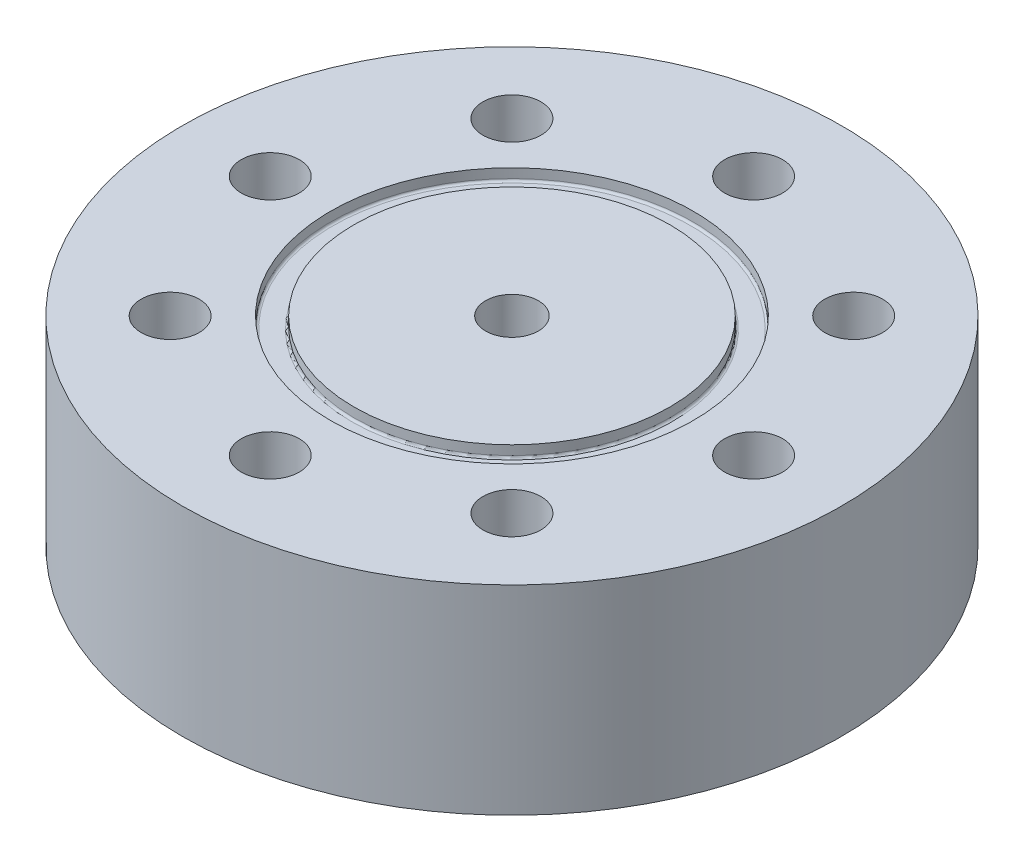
ISO-10303-21;
HEADER;
FILE_DESCRIPTION(('STEP AP214'),'2;1');
FILE_NAME('part.step','',(''),(''),'','','');
FILE_SCHEMA(('AUTOMOTIVE_DESIGN { 1 0 10303 214 1 1 1 1 }'));
ENDSEC;
DATA;
#1=APPLICATION_CONTEXT('core data for automotive mechanical design processes');
#2=APPLICATION_PROTOCOL_DEFINITION('international standard','automotive_design',2000,#1);
#3=PRODUCT_CONTEXT('',#1,'mechanical');
#4=PRODUCT('Part','Part','',(#3));
#5=PRODUCT_RELATED_PRODUCT_CATEGORY('part','',(#4));
#6=PRODUCT_DEFINITION_FORMATION('','',#4);
#7=PRODUCT_DEFINITION_CONTEXT('part definition',#1,'design');
#8=PRODUCT_DEFINITION('design','',#6,#7);
#9=PRODUCT_DEFINITION_SHAPE('','',#8);
#10=(LENGTH_UNIT() NAMED_UNIT(*) SI_UNIT(.MILLI.,.METRE.));
#11=(NAMED_UNIT(*) PLANE_ANGLE_UNIT() SI_UNIT($,.RADIAN.));
#12=(NAMED_UNIT(*) SI_UNIT($,.STERADIAN.) SOLID_ANGLE_UNIT());
#13=UNCERTAINTY_MEASURE_WITH_UNIT(LENGTH_MEASURE(1.E-05),#10,'distance_accuracy_value','');
#14=(GEOMETRIC_REPRESENTATION_CONTEXT(3) GLOBAL_UNCERTAINTY_ASSIGNED_CONTEXT((#13)) GLOBAL_UNIT_ASSIGNED_CONTEXT((#10,
#11,#12)) REPRESENTATION_CONTEXT('',''));
#15=CARTESIAN_POINT('',(0.,0.,0.));
#16=DIRECTION('',(0.,0.,1.));
#17=DIRECTION('',(1.,0.,0.));
#18=AXIS2_PLACEMENT_3D('',#15,#16,#17);
#19=CARTESIAN_POINT('',(0.,22.7,0.));
#20=DIRECTION('',(0.,-1.,0.));
#21=DIRECTION('',(0.,0.,-1.));
#22=AXIS2_PLACEMENT_3D('',#19,#20,#21);
#23=CYLINDRICAL_SURFACE('',#22,37.5);
#24=CARTESIAN_POINT('',(0.,22.7,0.));
#25=DIRECTION('',(0.,1.,0.));
#26=DIRECTION('',(0.,0.,1.));
#27=AXIS2_PLACEMENT_3D('',#24,#25,#26);
#28=CIRCLE('',#27,37.5);
#29=CARTESIAN_POINT('',(0.,22.7,37.5));
#30=VERTEX_POINT('',#29);
#31=EDGE_CURVE('E60',#30,#30,#28,.T.);
#32=ORIENTED_EDGE('',*,*,#31,.F.);
#33=EDGE_LOOP('',(#32));
#34=FACE_BOUND('',#33,.T.);
#35=CARTESIAN_POINT('',(0.,0.,0.));
#36=DIRECTION('',(0.,1.,0.));
#37=DIRECTION('',(0.,0.,1.));
#38=AXIS2_PLACEMENT_3D('',#35,#36,#37);
#39=CIRCLE('',#38,37.5);
#40=CARTESIAN_POINT('',(0.,0.,37.5));
#41=VERTEX_POINT('',#40);
#42=EDGE_CURVE('E61',#41,#41,#39,.T.);
#43=ORIENTED_EDGE('',*,*,#42,.T.);
#44=EDGE_LOOP('',(#43));
#45=FACE_BOUND('',#44,.T.);
#46=ADVANCED_FACE('F36',(#34,#45),#23,.T.);
#47=CARTESIAN_POINT('',(0.,22.7,0.));
#48=DIRECTION('',(0.,1.,0.));
#49=DIRECTION('',(0.,0.,1.));
#50=AXIS2_PLACEMENT_3D('',#47,#48,#49);
#51=PLANE('',#50);
#52=CARTESIAN_POINT('',(0.,22.7,0.));
#53=DIRECTION('',(0.,1.,0.));
#54=DIRECTION('',(0.,0.,1.));
#55=AXIS2_PLACEMENT_3D('',#52,#53,#54);
#56=CIRCLE('',#55,20.6375);
#57=CARTESIAN_POINT('',(0.,22.7,20.6375));
#58=VERTEX_POINT('',#57);
#59=EDGE_CURVE('E82',#58,#58,#56,.T.);
#60=ORIENTED_EDGE('',*,*,#59,.F.);
#61=EDGE_LOOP('',(#60));
#62=FACE_BOUND('',#61,.T.);
#63=CARTESIAN_POINT('',(-27.5,22.7,0.));
#64=DIRECTION('',(0.,-1.,0.));
#65=DIRECTION('',(0.,0.,-1.));
#66=AXIS2_PLACEMENT_3D('',#63,#64,#65);
#67=CIRCLE('',#66,3.3);
#68=CARTESIAN_POINT('',(-27.5,22.7,-3.3));
#69=VERTEX_POINT('',#68);
#70=EDGE_CURVE('E73',#69,#69,#67,.T.);
#71=ORIENTED_EDGE('',*,*,#70,.T.);
#72=EDGE_LOOP('',(#71));
#73=FACE_BOUND('',#72,.T.);
#74=CARTESIAN_POINT('',(-19.44543648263,22.7,19.4454364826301));
#75=DIRECTION('',(0.,-1.,0.));
#76=DIRECTION('',(0.,0.,-1.));
#77=AXIS2_PLACEMENT_3D('',#74,#75,#76);
#78=CIRCLE('',#77,3.30000000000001);
#79=CARTESIAN_POINT('',(-19.44543648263,22.7,16.1454364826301));
#80=VERTEX_POINT('',#79);
#81=EDGE_CURVE('E130',#80,#80,#78,.T.);
#82=ORIENTED_EDGE('',*,*,#81,.T.);
#83=EDGE_LOOP('',(#82));
#84=FACE_BOUND('',#83,.T.);
#85=CARTESIAN_POINT('',(0.,22.7,27.5));
#86=DIRECTION('',(0.,-1.,0.));
#87=DIRECTION('',(0.,0.,-1.));
#88=AXIS2_PLACEMENT_3D('',#85,#86,#87);
#89=CIRCLE('',#88,3.3);
#90=CARTESIAN_POINT('',(0.,22.7,24.2));
#91=VERTEX_POINT('',#90);
#92=EDGE_CURVE('E122',#91,#91,#89,.T.);
#93=ORIENTED_EDGE('',*,*,#92,.T.);
#94=EDGE_LOOP('',(#93));
#95=FACE_BOUND('',#94,.T.);
#96=CARTESIAN_POINT('',(19.4454364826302,22.7,19.44543648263));
#97=DIRECTION('',(0.,-1.,0.));
#98=DIRECTION('',(0.,0.,-1.));
#99=AXIS2_PLACEMENT_3D('',#96,#97,#98);
#100=CIRCLE('',#99,3.3);
#101=CARTESIAN_POINT('',(19.4454364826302,22.7,16.14543648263));
#102=VERTEX_POINT('',#101);
#103=EDGE_CURVE('E114',#102,#102,#100,.T.);
#104=ORIENTED_EDGE('',*,*,#103,.T.);
#105=EDGE_LOOP('',(#104));
#106=FACE_BOUND('',#105,.T.);
#107=CARTESIAN_POINT('',(27.5,22.7,-1.92031473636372E-13));
#108=DIRECTION('',(0.,-1.,0.));
#109=DIRECTION('',(0.,0.,-1.));
#110=AXIS2_PLACEMENT_3D('',#107,#108,#109);
#111=CIRCLE('',#110,3.3);
#112=CARTESIAN_POINT('',(27.5,22.7,-3.30000000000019));
#113=VERTEX_POINT('',#112);
#114=EDGE_CURVE('E106',#113,#113,#111,.T.);
#115=ORIENTED_EDGE('',*,*,#114,.T.);
#116=EDGE_LOOP('',(#115));
#117=FACE_BOUND('',#116,.T.);
#118=CARTESIAN_POINT('',(19.4454364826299,22.7,-19.4454364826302));
#119=DIRECTION('',(0.,-1.,0.));
#120=DIRECTION('',(0.,0.,-1.));
#121=AXIS2_PLACEMENT_3D('',#118,#119,#120);
#122=CIRCLE('',#121,3.3);
#123=CARTESIAN_POINT('',(19.4454364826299,22.7,-22.7454364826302));
#124=VERTEX_POINT('',#123);
#125=EDGE_CURVE('E98',#124,#124,#122,.T.);
#126=ORIENTED_EDGE('',*,*,#125,.T.);
#127=EDGE_LOOP('',(#126));
#128=FACE_BOUND('',#127,.T.);
#129=CARTESIAN_POINT('',(-2.88047210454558E-13,22.7,-27.5));
#130=DIRECTION('',(0.,-1.,0.));
#131=DIRECTION('',(0.,0.,-1.));
#132=AXIS2_PLACEMENT_3D('',#129,#130,#131);
#133=CIRCLE('',#132,3.3);
#134=CARTESIAN_POINT('',(-2.88047210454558E-13,22.7,-30.8));
#135=VERTEX_POINT('',#134);
#136=EDGE_CURVE('E90',#135,#135,#133,.T.);
#137=ORIENTED_EDGE('',*,*,#136,.T.);
#138=EDGE_LOOP('',(#137));
#139=FACE_BOUND('',#138,.T.);
#140=CARTESIAN_POINT('',(-19.4454364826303,22.7,-19.4454364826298));
#141=DIRECTION('',(0.,-1.,0.));
#142=DIRECTION('',(0.,0.,-1.));
#143=AXIS2_PLACEMENT_3D('',#140,#141,#142);
#144=CIRCLE('',#143,3.3);
#145=CARTESIAN_POINT('',(-19.4454364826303,22.7,-22.7454364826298));
#146=VERTEX_POINT('',#145);
#147=EDGE_CURVE('E81',#146,#146,#144,.T.);
#148=ORIENTED_EDGE('',*,*,#147,.T.);
#149=EDGE_LOOP('',(#148));
#150=FACE_BOUND('',#149,.T.);
#151=ORIENTED_EDGE('',*,*,#31,.T.);
#152=EDGE_LOOP('',(#151));
#153=FACE_BOUND('',#152,.T.);
#154=ADVANCED_FACE('F172',(#62,#73,#84,#95,#106,#117,#128,#139,#150,#153),#51,.T.);
#155=CARTESIAN_POINT('',(0.,0.,0.));
#156=DIRECTION('',(0.,1.,0.));
#157=DIRECTION('',(0.,0.,1.));
#158=AXIS2_PLACEMENT_3D('',#155,#156,#157);
#159=PLANE('',#158);
#160=CARTESIAN_POINT('',(-27.5,0.,0.));
#161=DIRECTION('',(0.,-1.,0.));
#162=DIRECTION('',(0.,0.,-1.));
#163=AXIS2_PLACEMENT_3D('',#160,#161,#162);
#164=CIRCLE('',#163,3.3);
#165=CARTESIAN_POINT('',(-27.5,0.,-3.3));
#166=VERTEX_POINT('',#165);
#167=EDGE_CURVE('E134',#166,#166,#164,.T.);
#168=ORIENTED_EDGE('',*,*,#167,.F.);
#169=EDGE_LOOP('',(#168));
#170=FACE_BOUND('',#169,.T.);
#171=CARTESIAN_POINT('',(-19.44543648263,0.,19.4454364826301));
#172=DIRECTION('',(0.,-1.,0.));
#173=DIRECTION('',(0.,0.,-1.));
#174=AXIS2_PLACEMENT_3D('',#171,#172,#173);
#175=CIRCLE('',#174,3.30000000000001);
#176=CARTESIAN_POINT('',(-19.44543648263,0.,16.1454364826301));
#177=VERTEX_POINT('',#176);
#178=EDGE_CURVE('E126',#177,#177,#175,.T.);
#179=ORIENTED_EDGE('',*,*,#178,.F.);
#180=EDGE_LOOP('',(#179));
#181=FACE_BOUND('',#180,.T.);
#182=CARTESIAN_POINT('',(0.,0.,27.5));
#183=DIRECTION('',(0.,-1.,0.));
#184=DIRECTION('',(0.,0.,-1.));
#185=AXIS2_PLACEMENT_3D('',#182,#183,#184);
#186=CIRCLE('',#185,3.3);
#187=CARTESIAN_POINT('',(0.,0.,24.2));
#188=VERTEX_POINT('',#187);
#189=EDGE_CURVE('E118',#188,#188,#186,.T.);
#190=ORIENTED_EDGE('',*,*,#189,.F.);
#191=EDGE_LOOP('',(#190));
#192=FACE_BOUND('',#191,.T.);
#193=CARTESIAN_POINT('',(19.4454364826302,0.,19.44543648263));
#194=DIRECTION('',(0.,-1.,0.));
#195=DIRECTION('',(0.,0.,-1.));
#196=AXIS2_PLACEMENT_3D('',#193,#194,#195);
#197=CIRCLE('',#196,3.3);
#198=CARTESIAN_POINT('',(19.4454364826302,0.,16.14543648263));
#199=VERTEX_POINT('',#198);
#200=EDGE_CURVE('E110',#199,#199,#197,.T.);
#201=ORIENTED_EDGE('',*,*,#200,.F.);
#202=EDGE_LOOP('',(#201));
#203=FACE_BOUND('',#202,.T.);
#204=CARTESIAN_POINT('',(27.5,0.,-1.92031473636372E-13));
#205=DIRECTION('',(0.,-1.,0.));
#206=DIRECTION('',(0.,0.,-1.));
#207=AXIS2_PLACEMENT_3D('',#204,#205,#206);
#208=CIRCLE('',#207,3.3);
#209=CARTESIAN_POINT('',(27.5,0.,-3.30000000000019));
#210=VERTEX_POINT('',#209);
#211=EDGE_CURVE('E102',#210,#210,#208,.T.);
#212=ORIENTED_EDGE('',*,*,#211,.F.);
#213=EDGE_LOOP('',(#212));
#214=FACE_BOUND('',#213,.T.);
#215=CARTESIAN_POINT('',(19.4454364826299,0.,-19.4454364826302));
#216=DIRECTION('',(0.,-1.,0.));
#217=DIRECTION('',(0.,0.,-1.));
#218=AXIS2_PLACEMENT_3D('',#215,#216,#217);
#219=CIRCLE('',#218,3.3);
#220=CARTESIAN_POINT('',(19.4454364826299,0.,-22.7454364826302));
#221=VERTEX_POINT('',#220);
#222=EDGE_CURVE('E94',#221,#221,#219,.T.);
#223=ORIENTED_EDGE('',*,*,#222,.F.);
#224=EDGE_LOOP('',(#223));
#225=FACE_BOUND('',#224,.T.);
#226=CARTESIAN_POINT('',(-2.88047210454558E-13,0.,-27.5));
#227=DIRECTION('',(0.,-1.,0.));
#228=DIRECTION('',(0.,0.,-1.));
#229=AXIS2_PLACEMENT_3D('',#226,#227,#228);
#230=CIRCLE('',#229,3.3);
#231=CARTESIAN_POINT('',(-2.88047210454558E-13,0.,-30.8));
#232=VERTEX_POINT('',#231);
#233=EDGE_CURVE('E86',#232,#232,#230,.T.);
#234=ORIENTED_EDGE('',*,*,#233,.F.);
#235=EDGE_LOOP('',(#234));
#236=FACE_BOUND('',#235,.T.);
#237=CARTESIAN_POINT('',(-19.4454364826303,0.,-19.4454364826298));
#238=DIRECTION('',(0.,-1.,0.));
#239=DIRECTION('',(0.,0.,-1.));
#240=AXIS2_PLACEMENT_3D('',#237,#238,#239);
#241=CIRCLE('',#240,3.3);
#242=CARTESIAN_POINT('',(-19.4454364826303,0.,-22.7454364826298));
#243=VERTEX_POINT('',#242);
#244=EDGE_CURVE('E77',#243,#243,#241,.T.);
#245=ORIENTED_EDGE('',*,*,#244,.F.);
#246=EDGE_LOOP('',(#245));
#247=FACE_BOUND('',#246,.T.);
#248=CARTESIAN_POINT('',(0.,0.,0.));
#249=DIRECTION('',(0.,-1.,0.));
#250=DIRECTION('',(0.,0.,-1.));
#251=AXIS2_PLACEMENT_3D('',#248,#249,#250);
#252=CIRCLE('',#251,8.93);
#253=CARTESIAN_POINT('',(0.,0.,-8.93));
#254=VERTEX_POINT('',#253);
#255=EDGE_CURVE('E69',#254,#254,#252,.T.);
#256=ORIENTED_EDGE('',*,*,#255,.F.);
#257=EDGE_LOOP('',(#256));
#258=FACE_BOUND('',#257,.T.);
#259=ORIENTED_EDGE('',*,*,#42,.F.);
#260=EDGE_LOOP('',(#259));
#261=FACE_BOUND('',#260,.T.);
#262=ADVANCED_FACE('F192',(#170,#181,#192,#203,#214,#225,#236,#247,#258,#261),#159,.F.);
#263=CARTESIAN_POINT('',(0.,12.7,0.));
#264=DIRECTION('',(0.,-1.,0.));
#265=DIRECTION('',(0.,0.,-1.));
#266=AXIS2_PLACEMENT_3D('',#263,#264,#265);
#267=CYLINDRICAL_SURFACE('',#266,8.93);
#268=CARTESIAN_POINT('',(0.,12.7,0.));
#269=DIRECTION('',(0.,-1.,0.));
#270=DIRECTION('',(0.,0.,-1.));
#271=AXIS2_PLACEMENT_3D('',#268,#269,#270);
#272=CIRCLE('',#271,8.93);
#273=CARTESIAN_POINT('',(0.,12.7,-8.93));
#274=VERTEX_POINT('',#273);
#275=EDGE_CURVE('E65',#274,#274,#272,.T.);
#276=ORIENTED_EDGE('',*,*,#275,.F.);
#277=EDGE_LOOP('',(#276));
#278=FACE_BOUND('',#277,.T.);
#279=ORIENTED_EDGE('',*,*,#255,.T.);
#280=EDGE_LOOP('',(#279));
#281=FACE_BOUND('',#280,.T.);
#282=ADVANCED_FACE('F228',(#278,#281),#267,.F.);
#283=CARTESIAN_POINT('',(0.,12.7,0.));
#284=DIRECTION('',(0.,-1.,0.));
#285=DIRECTION('',(0.,0.,-1.));
#286=AXIS2_PLACEMENT_3D('',#283,#284,#285);
#287=PLANE('',#286);
#288=CARTESIAN_POINT('',(0.,12.7,0.));
#289=DIRECTION('',(0.,1.,0.));
#290=DIRECTION('',(0.,0.,1.));
#291=AXIS2_PLACEMENT_3D('',#288,#289,#290);
#292=CIRCLE('',#291,3.);
#293=CARTESIAN_POINT('',(0.,12.7,3.));
#294=VERTEX_POINT('',#293);
#295=EDGE_CURVE('E148',#294,#294,#292,.T.);
#296=ORIENTED_EDGE('',*,*,#295,.T.);
#297=EDGE_LOOP('',(#296));
#298=FACE_BOUND('',#297,.T.);
#299=ORIENTED_EDGE('',*,*,#275,.T.);
#300=EDGE_LOOP('',(#299));
#301=FACE_BOUND('',#300,.T.);
#302=ADVANCED_FACE('F157',(#298,#301),#287,.T.);
#303=CARTESIAN_POINT('',(-19.4454364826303,22.7,-19.4454364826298));
#304=DIRECTION('',(0.,-1.,0.));
#305=DIRECTION('',(0.,0.,-1.));
#306=AXIS2_PLACEMENT_3D('',#303,#304,#305);
#307=CYLINDRICAL_SURFACE('',#306,3.3);
#308=ORIENTED_EDGE('',*,*,#147,.F.);
#309=EDGE_LOOP('',(#308));
#310=FACE_BOUND('',#309,.T.);
#311=ORIENTED_EDGE('',*,*,#244,.T.);
#312=EDGE_LOOP('',(#311));
#313=FACE_BOUND('',#312,.T.);
#314=ADVANCED_FACE('F227',(#310,#313),#307,.F.);
#315=CARTESIAN_POINT('',(-2.88047210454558E-13,22.7,-27.5));
#316=DIRECTION('',(0.,-1.,0.));
#317=DIRECTION('',(0.,0.,-1.));
#318=AXIS2_PLACEMENT_3D('',#315,#316,#317);
#319=CYLINDRICAL_SURFACE('',#318,3.3);
#320=ORIENTED_EDGE('',*,*,#136,.F.);
#321=EDGE_LOOP('',(#320));
#322=FACE_BOUND('',#321,.T.);
#323=ORIENTED_EDGE('',*,*,#233,.T.);
#324=EDGE_LOOP('',(#323));
#325=FACE_BOUND('',#324,.T.);
#326=ADVANCED_FACE('F244',(#322,#325),#319,.F.);
#327=CARTESIAN_POINT('',(19.4454364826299,22.7,-19.4454364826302));
#328=DIRECTION('',(0.,-1.,0.));
#329=DIRECTION('',(0.,0.,-1.));
#330=AXIS2_PLACEMENT_3D('',#327,#328,#329);
#331=CYLINDRICAL_SURFACE('',#330,3.3);
#332=ORIENTED_EDGE('',*,*,#125,.F.);
#333=EDGE_LOOP('',(#332));
#334=FACE_BOUND('',#333,.T.);
#335=ORIENTED_EDGE('',*,*,#222,.T.);
#336=EDGE_LOOP('',(#335));
#337=FACE_BOUND('',#336,.T.);
#338=ADVANCED_FACE('F252',(#334,#337),#331,.F.);
#339=CARTESIAN_POINT('',(27.5,22.7,-1.92031473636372E-13));
#340=DIRECTION('',(0.,-1.,0.));
#341=DIRECTION('',(0.,0.,-1.));
#342=AXIS2_PLACEMENT_3D('',#339,#340,#341);
#343=CYLINDRICAL_SURFACE('',#342,3.3);
#344=ORIENTED_EDGE('',*,*,#114,.F.);
#345=EDGE_LOOP('',(#344));
#346=FACE_BOUND('',#345,.T.);
#347=ORIENTED_EDGE('',*,*,#211,.T.);
#348=EDGE_LOOP('',(#347));
#349=FACE_BOUND('',#348,.T.);
#350=ADVANCED_FACE('F260',(#346,#349),#343,.F.);
#351=CARTESIAN_POINT('',(19.4454364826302,22.7,19.44543648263));
#352=DIRECTION('',(0.,-1.,0.));
#353=DIRECTION('',(0.,0.,-1.));
#354=AXIS2_PLACEMENT_3D('',#351,#352,#353);
#355=CYLINDRICAL_SURFACE('',#354,3.3);
#356=ORIENTED_EDGE('',*,*,#103,.F.);
#357=EDGE_LOOP('',(#356));
#358=FACE_BOUND('',#357,.T.);
#359=ORIENTED_EDGE('',*,*,#200,.T.);
#360=EDGE_LOOP('',(#359));
#361=FACE_BOUND('',#360,.T.);
#362=ADVANCED_FACE('F268',(#358,#361),#355,.F.);
#363=CARTESIAN_POINT('',(0.,22.7,27.5));
#364=DIRECTION('',(0.,-1.,0.));
#365=DIRECTION('',(0.,0.,-1.));
#366=AXIS2_PLACEMENT_3D('',#363,#364,#365);
#367=CYLINDRICAL_SURFACE('',#366,3.3);
#368=ORIENTED_EDGE('',*,*,#92,.F.);
#369=EDGE_LOOP('',(#368));
#370=FACE_BOUND('',#369,.T.);
#371=ORIENTED_EDGE('',*,*,#189,.T.);
#372=EDGE_LOOP('',(#371));
#373=FACE_BOUND('',#372,.T.);
#374=ADVANCED_FACE('F276',(#370,#373),#367,.F.);
#375=CARTESIAN_POINT('',(-19.44543648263,22.7,19.4454364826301));
#376=DIRECTION('',(0.,-1.,0.));
#377=DIRECTION('',(0.,0.,-1.));
#378=AXIS2_PLACEMENT_3D('',#375,#376,#377);
#379=CYLINDRICAL_SURFACE('',#378,3.30000000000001);
#380=ORIENTED_EDGE('',*,*,#81,.F.);
#381=EDGE_LOOP('',(#380));
#382=FACE_BOUND('',#381,.T.);
#383=ORIENTED_EDGE('',*,*,#178,.T.);
#384=EDGE_LOOP('',(#383));
#385=FACE_BOUND('',#384,.T.);
#386=ADVANCED_FACE('F284',(#382,#385),#379,.F.);
#387=CARTESIAN_POINT('',(-27.5,22.7,0.));
#388=DIRECTION('',(0.,-1.,0.));
#389=DIRECTION('',(0.,0.,-1.));
#390=AXIS2_PLACEMENT_3D('',#387,#388,#389);
#391=CYLINDRICAL_SURFACE('',#390,3.3);
#392=ORIENTED_EDGE('',*,*,#70,.F.);
#393=EDGE_LOOP('',(#392));
#394=FACE_BOUND('',#393,.T.);
#395=ORIENTED_EDGE('',*,*,#167,.T.);
#396=EDGE_LOOP('',(#395));
#397=FACE_BOUND('',#396,.T.);
#398=ADVANCED_FACE('F292',(#394,#397),#391,.F.);
#399=CARTESIAN_POINT('',(0.,21.3792,0.));
#400=DIRECTION('',(0.,1.,0.));
#401=DIRECTION('',(0.,0.,1.));
#402=AXIS2_PLACEMENT_3D('',#399,#400,#401);
#403=CYLINDRICAL_SURFACE('',#402,20.6375);
#404=CARTESIAN_POINT('',(0.,21.6332,0.));
#405=DIRECTION('',(0.,1.,0.));
#406=DIRECTION('',(0.,0.,1.));
#407=AXIS2_PLACEMENT_3D('',#404,#405,#406);
#408=CIRCLE('',#407,20.6375);
#409=CARTESIAN_POINT('',(0.,21.6332,20.6375));
#410=VERTEX_POINT('',#409);
#411=EDGE_CURVE('E10',#410,#410,#408,.F.);
#412=ORIENTED_EDGE('',*,*,#411,.T.);
#413=EDGE_LOOP('',(#412));
#414=FACE_BOUND('',#413,.T.);
#415=ORIENTED_EDGE('',*,*,#59,.T.);
#416=EDGE_LOOP('',(#415));
#417=FACE_BOUND('',#416,.T.);
#418=ADVANCED_FACE('F183',(#414,#417),#403,.F.);
#419=CARTESIAN_POINT('',(0.,21.3792,0.));
#420=DIRECTION('',(0.,1.,0.));
#421=DIRECTION('',(0.,0.,1.));
#422=AXIS2_PLACEMENT_3D('',#419,#420,#421);
#423=PLANE('',#422);
#424=CARTESIAN_POINT('',(0.,21.3792,0.));
#425=DIRECTION('',(0.,1.,0.));
#426=DIRECTION('',(0.,0.,1.));
#427=AXIS2_PLACEMENT_3D('',#424,#425,#426);
#428=CIRCLE('',#427,18.2245);
#429=CARTESIAN_POINT('',(0.,21.3792,18.2245));
#430=VERTEX_POINT('',#429);
#431=EDGE_CURVE('E44',#430,#430,#428,.F.);
#432=ORIENTED_EDGE('',*,*,#431,.T.);
#433=EDGE_LOOP('',(#432));
#434=FACE_BOUND('',#433,.T.);
#435=CARTESIAN_POINT('',(0.,21.3792,0.));
#436=DIRECTION('',(0.,1.,0.));
#437=DIRECTION('',(0.,0.,1.));
#438=AXIS2_PLACEMENT_3D('',#435,#436,#437);
#439=CIRCLE('',#438,20.3835);
#440=CARTESIAN_POINT('',(0.,21.3792,20.3835));
#441=VERTEX_POINT('',#440);
#442=EDGE_CURVE('E49',#441,#441,#439,.T.);
#443=ORIENTED_EDGE('',*,*,#442,.T.);
#444=EDGE_LOOP('',(#443));
#445=FACE_BOUND('',#444,.T.);
#446=ADVANCED_FACE('F176',(#434,#445),#423,.T.);
#447=CARTESIAN_POINT('',(0.,21.3792,0.));
#448=DIRECTION('',(0.,1.,0.));
#449=DIRECTION('',(0.,0.,1.));
#450=AXIS2_PLACEMENT_3D('',#447,#448,#449);
#451=CYLINDRICAL_SURFACE('',#450,17.9705);
#452=CARTESIAN_POINT('',(0.,21.6332,0.));
#453=DIRECTION('',(0.,1.,0.));
#454=DIRECTION('',(0.,0.,1.));
#455=AXIS2_PLACEMENT_3D('',#452,#453,#454);
#456=CIRCLE('',#455,17.9705);
#457=CARTESIAN_POINT('',(0.,21.6332,17.9705));
#458=VERTEX_POINT('',#457);
#459=EDGE_CURVE('E54',#458,#458,#456,.T.);
#460=ORIENTED_EDGE('',*,*,#459,.T.);
#461=EDGE_LOOP('',(#460));
#462=FACE_BOUND('',#461,.T.);
#463=CARTESIAN_POINT('',(0.,22.7,0.));
#464=DIRECTION('',(0.,1.,0.));
#465=DIRECTION('',(0.,0.,1.));
#466=AXIS2_PLACEMENT_3D('',#463,#464,#465);
#467=CIRCLE('',#466,17.9705);
#468=CARTESIAN_POINT('',(0.,22.7,17.9705));
#469=VERTEX_POINT('',#468);
#470=EDGE_CURVE('E144',#469,#469,#467,.T.);
#471=ORIENTED_EDGE('',*,*,#470,.F.);
#472=EDGE_LOOP('',(#471));
#473=FACE_BOUND('',#472,.T.);
#474=ADVANCED_FACE('F170',(#462,#473),#451,.T.);
#475=CARTESIAN_POINT('',(0.,22.7,0.));
#476=DIRECTION('',(0.,1.,0.));
#477=DIRECTION('',(0.,0.,1.));
#478=AXIS2_PLACEMENT_3D('',#475,#476,#477);
#479=CIRCLE('',#478,3.);
#480=CARTESIAN_POINT('',(0.,22.7,3.));
#481=VERTEX_POINT('',#480);
#482=EDGE_CURVE('E149',#481,#481,#479,.T.);
#483=ORIENTED_EDGE('',*,*,#482,.F.);
#484=EDGE_LOOP('',(#483));
#485=FACE_BOUND('',#484,.T.);
#486=ORIENTED_EDGE('',*,*,#470,.T.);
#487=EDGE_LOOP('',(#486));
#488=FACE_BOUND('',#487,.T.);
#489=ADVANCED_FACE('F166',(#485,#488),#51,.T.);
#490=CARTESIAN_POINT('',(0.,21.6332,0.));
#491=DIRECTION('',(0.,1.,0.));
#492=DIRECTION('',(0.,0.,1.));
#493=AXIS2_PLACEMENT_3D('',#490,#491,#492);
#494=TOROIDAL_SURFACE('',#493,18.2245,0.254);
#495=ORIENTED_EDGE('',*,*,#431,.F.);
#496=EDGE_LOOP('',(#495));
#497=FACE_BOUND('',#496,.T.);
#498=ORIENTED_EDGE('',*,*,#459,.F.);
#499=EDGE_LOOP('',(#498));
#500=FACE_BOUND('',#499,.T.);
#501=ADVANCED_FACE('F169',(#497,#500),#494,.F.);
#502=CARTESIAN_POINT('',(0.,21.6332,0.));
#503=DIRECTION('',(0.,1.,0.));
#504=DIRECTION('',(0.,0.,1.));
#505=AXIS2_PLACEMENT_3D('',#502,#503,#504);
#506=TOROIDAL_SURFACE('',#505,20.3835,0.254);
#507=ORIENTED_EDGE('',*,*,#411,.F.);
#508=EDGE_LOOP('',(#507));
#509=FACE_BOUND('',#508,.T.);
#510=ORIENTED_EDGE('',*,*,#442,.F.);
#511=EDGE_LOOP('',(#510));
#512=FACE_BOUND('',#511,.T.);
#513=ADVANCED_FACE('F38',(#509,#512),#506,.F.);
#514=CARTESIAN_POINT('',(0.,12.7,0.));
#515=DIRECTION('',(0.,1.,0.));
#516=DIRECTION('',(0.,0.,1.));
#517=AXIS2_PLACEMENT_3D('',#514,#515,#516);
#518=CYLINDRICAL_SURFACE('',#517,3.);
#519=ORIENTED_EDGE('',*,*,#295,.F.);
#520=EDGE_LOOP('',(#519));
#521=FACE_BOUND('',#520,.T.);
#522=ORIENTED_EDGE('',*,*,#482,.T.);
#523=EDGE_LOOP('',(#522));
#524=FACE_BOUND('',#523,.T.);
#525=ADVANCED_FACE('F160',(#521,#524),#518,.F.);
#526=CLOSED_SHELL('',(#46,#154,#262,#282,#302,#314,#326,#338,#350,#362,#374,#386,#398,#418,#446,
#474,#489,#501,#513,#525));
#527=MANIFOLD_SOLID_BREP('B2',#526);
#528=ADVANCED_BREP_SHAPE_REPRESENTATION('',(#18,#527),#14);
#529=SHAPE_DEFINITION_REPRESENTATION(#9,#528);
ENDSEC;
END-ISO-10303-21;
